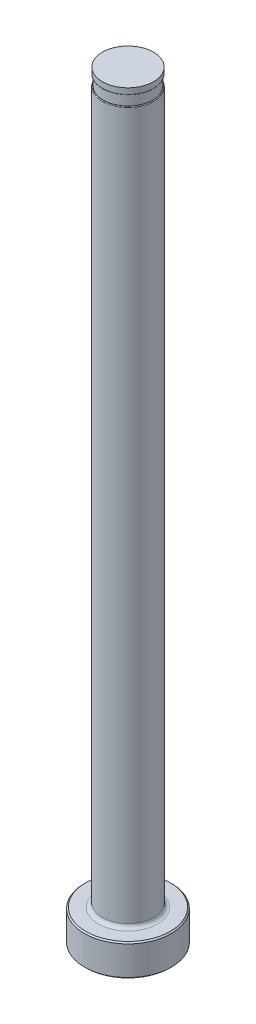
ISO-10303-21;
HEADER;
FILE_DESCRIPTION(('STEP AP214'),'2;1');
FILE_NAME('part.step','',(''),(''),'','','');
FILE_SCHEMA(('AUTOMOTIVE_DESIGN { 1 0 10303 214 1 1 1 1 }'));
ENDSEC;
DATA;
#1=APPLICATION_CONTEXT('core data for automotive mechanical design processes');
#2=APPLICATION_PROTOCOL_DEFINITION('international standard','automotive_design',2000,#1);
#3=PRODUCT_CONTEXT('',#1,'mechanical');
#4=PRODUCT('Part','Part','',(#3));
#5=PRODUCT_RELATED_PRODUCT_CATEGORY('part','',(#4));
#6=PRODUCT_DEFINITION_FORMATION('','',#4);
#7=PRODUCT_DEFINITION_CONTEXT('part definition',#1,'design');
#8=PRODUCT_DEFINITION('design','',#6,#7);
#9=PRODUCT_DEFINITION_SHAPE('','',#8);
#10=(LENGTH_UNIT() NAMED_UNIT(*) SI_UNIT(.MILLI.,.METRE.));
#11=(NAMED_UNIT(*) PLANE_ANGLE_UNIT() SI_UNIT($,.RADIAN.));
#12=(NAMED_UNIT(*) SI_UNIT($,.STERADIAN.) SOLID_ANGLE_UNIT());
#13=UNCERTAINTY_MEASURE_WITH_UNIT(LENGTH_MEASURE(1.E-05),#10,'distance_accuracy_value','');
#14=(GEOMETRIC_REPRESENTATION_CONTEXT(3) GLOBAL_UNCERTAINTY_ASSIGNED_CONTEXT((#13)) GLOBAL_UNIT_ASSIGNED_CONTEXT((#10,
#11,#12)) REPRESENTATION_CONTEXT('',''));
#15=CARTESIAN_POINT('',(0.,0.,0.));
#16=DIRECTION('',(0.,0.,1.));
#17=DIRECTION('',(1.,0.,0.));
#18=AXIS2_PLACEMENT_3D('',#15,#16,#17);
#19=CARTESIAN_POINT('',(-5.15873999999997,151.13,0.));
#20=DIRECTION('',(0.,1.,0.));
#21=DIRECTION('',(0.,0.,1.));
#22=AXIS2_PLACEMENT_3D('',#19,#20,#21);
#23=PLANE('',#22);
#24=CARTESIAN_POINT('',(0.,151.13,0.));
#25=DIRECTION('',(0.,1.,0.));
#26=DIRECTION('',(0.,0.,1.));
#27=AXIS2_PLACEMENT_3D('',#24,#25,#26);
#28=CIRCLE('',#27,5.01268999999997);
#29=CARTESIAN_POINT('',(0.,151.13,5.01268999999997));
#30=VERTEX_POINT('',#29);
#31=EDGE_CURVE('E11',#30,#30,#28,.F.);
#32=ORIENTED_EDGE('',*,*,#31,.T.);
#33=EDGE_LOOP('',(#32));
#34=FACE_BOUND('',#33,.T.);
#35=CARTESIAN_POINT('',(0.,151.13,0.));
#36=DIRECTION('',(0.,1.,0.));
#37=DIRECTION('',(0.,0.,1.));
#38=AXIS2_PLACEMENT_3D('',#35,#36,#37);
#39=CIRCLE('',#38,4.95553999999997);
#40=CARTESIAN_POINT('',(0.,151.13,4.95553999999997));
#41=VERTEX_POINT('',#40);
#42=EDGE_CURVE('E78',#41,#41,#39,.T.);
#43=ORIENTED_EDGE('',*,*,#42,.T.);
#44=EDGE_LOOP('',(#43));
#45=FACE_BOUND('',#44,.T.);
#46=ADVANCED_FACE('F36',(#34,#45),#23,.F.);
#47=CARTESIAN_POINT('',(0.,259.958771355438,0.));
#48=DIRECTION('',(0.,1.,0.));
#49=DIRECTION('',(0.,0.,1.));
#50=AXIS2_PLACEMENT_3D('',#47,#48,#49);
#51=CYLINDRICAL_SURFACE('',#50,5.15873999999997);
#52=DIRECTION('',(0.,1.,0.));
#53=VECTOR('',#52,1.);
#54=CARTESIAN_POINT('',(-4.95553999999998,259.958771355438,-1.43360444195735));
#55=LINE('',#54,#53);
#56=CARTESIAN_POINT('',(-4.95553999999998,148.971,-1.43360444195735));
#57=VERTEX_POINT('',#56);
#58=CARTESIAN_POINT('',(-4.95553999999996,86.614,-1.43360444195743));
#59=VERTEX_POINT('',#58);
#60=EDGE_CURVE('E73',#57,#59,#55,.F.);
#61=ORIENTED_EDGE('',*,*,#60,.F.);
#62=CARTESIAN_POINT('',(0.,148.971,0.));
#63=DIRECTION('',(0.,-1.,0.));
#64=DIRECTION('',(0.,0.,-1.));
#65=AXIS2_PLACEMENT_3D('',#62,#63,#64);
#66=CIRCLE('',#65,5.15873999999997);
#67=CARTESIAN_POINT('',(-4.95553999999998,148.971,1.43360444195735));
#68=VERTEX_POINT('',#67);
#69=EDGE_CURVE('E51',#57,#68,#66,.T.);
#70=ORIENTED_EDGE('',*,*,#69,.T.);
#71=DIRECTION('',(0.,1.,0.));
#72=VECTOR('',#71,1.);
#73=CARTESIAN_POINT('',(-4.95553999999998,259.958771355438,1.43360444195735));
#74=LINE('',#73,#72);
#75=CARTESIAN_POINT('',(-4.95553999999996,86.614,1.43360444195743));
#76=VERTEX_POINT('',#75);
#77=EDGE_CURVE('E84',#76,#68,#74,.T.);
#78=ORIENTED_EDGE('',*,*,#77,.F.);
#79=CARTESIAN_POINT('',(-4.95553999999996,86.614,-1.43360444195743));
#80=CARTESIAN_POINT('',(-4.95553725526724,86.5856189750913,-1.43360739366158));
#81=CARTESIAN_POINT('',(-4.95592104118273,86.5572557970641,-1.43228786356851));
#82=CARTESIAN_POINT('',(-4.95743326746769,86.5008072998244,-1.42704770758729));
#83=CARTESIAN_POINT('',(-4.9585612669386,86.4727218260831,-1.42312862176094));
#84=CARTESIAN_POINT('',(-4.9629961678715,86.3896356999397,-1.40761778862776));
#85=CARTESIAN_POINT('',(-4.96735491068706,86.3353485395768,-1.39227082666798));
#86=CARTESIAN_POINT('',(-4.97832723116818,86.2306470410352,-1.35250608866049));
#87=CARTESIAN_POINT('',(-4.98493672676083,86.18022589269,-1.32810472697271));
#88=CARTESIAN_POINT('',(-4.99967949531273,86.0841857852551,-1.27147840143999));
#89=CARTESIAN_POINT('',(-5.00781478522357,86.038573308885,-1.23924306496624));
#90=CARTESIAN_POINT('',(-5.02495905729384,85.9522108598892,-1.16779718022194));
#91=CARTESIAN_POINT('',(-5.03397951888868,85.9115461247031,-1.12848730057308));
#92=CARTESIAN_POINT('',(-5.05205730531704,85.8361357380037,-1.04458765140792));
#93=CARTESIAN_POINT('',(-5.0611146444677,85.8013926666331,-0.999995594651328));
#94=CARTESIAN_POINT('',(-5.0828087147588,85.722744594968,-0.884599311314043));
#95=CARTESIAN_POINT('',(-5.09511168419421,85.6822810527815,-0.811374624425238));
#96=CARTESIAN_POINT('',(-5.11705340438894,85.6135884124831,-0.659025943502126));
#97=CARTESIAN_POINT('',(-5.12668809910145,85.5853779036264,-0.579893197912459));
#98=CARTESIAN_POINT('',(-5.14250736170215,85.5402853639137,-0.417111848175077));
#99=CARTESIAN_POINT('',(-5.14864831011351,85.5235460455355,-0.333419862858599));
#100=CARTESIAN_POINT('',(-5.15681634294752,85.5014682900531,-0.164367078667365));
#101=CARTESIAN_POINT('',(-5.15884262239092,85.4961320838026,-0.0790059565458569));
#102=CARTESIAN_POINT('',(-5.15861184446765,85.4967349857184,0.105901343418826));
#103=CARTESIAN_POINT('',(-5.15558674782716,85.5046959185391,0.205446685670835));
#104=CARTESIAN_POINT('',(-5.14401053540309,85.5362458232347,0.401751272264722));
#105=CARTESIAN_POINT('',(-5.13546035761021,85.5598321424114,0.498510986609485));
#106=CARTESIAN_POINT('',(-5.11591338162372,85.6173193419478,0.667702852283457));
#107=CARTESIAN_POINT('',(-5.10571393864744,85.6483284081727,0.741210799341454));
#108=CARTESIAN_POINT('',(-5.08327564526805,85.7216570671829,0.882022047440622));
#109=CARTESIAN_POINT('',(-5.07103965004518,85.763960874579,0.949333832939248));
#110=CARTESIAN_POINT('',(-5.04847334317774,85.8504217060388,1.06213618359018));
#111=CARTESIAN_POINT('',(-5.03826194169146,85.892449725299,1.10927984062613));
#112=CARTESIAN_POINT('',(-5.01836605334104,85.9837827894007,1.19606762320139));
#113=CARTESIAN_POINT('',(-5.00868105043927,86.0330805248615,1.23571919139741));
#114=CARTESIAN_POINT('',(-4.99227488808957,86.1303011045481,1.30028176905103));
#115=CARTESIAN_POINT('',(-4.98532701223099,86.1773061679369,1.3265147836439));
#116=CARTESIAN_POINT('',(-4.97328889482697,86.2751640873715,1.37095861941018));
#117=CARTESIAN_POINT('',(-4.96819584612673,86.3260109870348,1.38918157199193));
#118=CARTESIAN_POINT('',(-4.96145831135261,86.4164594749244,1.41302693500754));
#119=CARTESIAN_POINT('',(-4.95925840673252,86.4554867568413,1.42070567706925));
#120=CARTESIAN_POINT('',(-4.95629015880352,86.5343307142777,1.43101136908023));
#121=CARTESIAN_POINT('',(-4.95552461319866,86.5741487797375,1.4336284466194));
#122=CARTESIAN_POINT('',(-4.95553999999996,86.614,1.43360444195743));
#123=B_SPLINE_CURVE_WITH_KNOTS('',3,(#79,#80,#81,#82,#83,#84,#85,#86,#87,#88,#89,#90,#91,#92,
#93,#94,#95,#96,#97,#98,#99,#100,#101,#102,#103,#104,#105,#106,#107,#108,#109,#110,#111,#112,
#113,#114,#115,#116,#117,#118,#119,#120,#121,#122),.UNSPECIFIED.,.F.,.F.,(4,2,2,2,2,2,2,2,2,2,2,
2,2,2,2,2,2,2,2,2,2,4),(0.,0.0850755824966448,0.170100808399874,0.338803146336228,
0.507201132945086,0.675823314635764,0.84702982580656,1.01831074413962,1.27062211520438,
1.52331494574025,1.77909706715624,2.03492922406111,2.33328986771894,2.63159987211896,
2.87199032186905,3.11204654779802,3.30325159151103,3.49426568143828,3.6564175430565,
3.81832296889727,3.93749321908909,4.05689566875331),.UNSPECIFIED.);
#124=EDGE_CURVE('E81',#59,#76,#123,.T.);
#125=ORIENTED_EDGE('',*,*,#124,.F.);
#126=EDGE_LOOP('',(#61,#70,#78,#125));
#127=FACE_BOUND('',#126,.T.);
#128=CARTESIAN_POINT('',(0.,7.11200000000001,0.));
#129=DIRECTION('',(0.,1.,0.));
#130=DIRECTION('',(0.,0.,1.));
#131=AXIS2_PLACEMENT_3D('',#128,#129,#130);
#132=CIRCLE('',#131,5.15873999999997);
#133=CARTESIAN_POINT('',(0.,7.11200000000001,5.15873999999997));
#134=VERTEX_POINT('',#133);
#135=EDGE_CURVE('E116',#134,#134,#132,.T.);
#136=ORIENTED_EDGE('',*,*,#135,.T.);
#137=EDGE_LOOP('',(#136));
#138=FACE_BOUND('',#137,.T.);
#139=ADVANCED_FACE('F82',(#127,#138),#51,.T.);
#140=CARTESIAN_POINT('',(0.,0.,0.));
#141=DIRECTION('',(0.,-1.,0.));
#142=DIRECTION('',(0.,0.,-1.));
#143=AXIS2_PLACEMENT_3D('',#140,#141,#142);
#144=PLANE('',#143);
#145=CARTESIAN_POINT('',(0.,0.,0.));
#146=DIRECTION('',(0.,-1.,0.));
#147=DIRECTION('',(0.,0.,-1.));
#148=AXIS2_PLACEMENT_3D('',#145,#146,#147);
#149=CIRCLE('',#148,8.47089999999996);
#150=CARTESIAN_POINT('',(0.,0.,-8.47089999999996));
#151=VERTEX_POINT('',#150);
#152=EDGE_CURVE('E113',#151,#151,#149,.T.);
#153=ORIENTED_EDGE('',*,*,#152,.T.);
#154=EDGE_LOOP('',(#153));
#155=FACE_BOUND('',#154,.T.);
#156=ADVANCED_FACE('F192',(#155),#144,.T.);
#157=CARTESIAN_POINT('',(0.,259.958771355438,0.));
#158=DIRECTION('',(0.,1.,0.));
#159=DIRECTION('',(0.,0.,1.));
#160=AXIS2_PLACEMENT_3D('',#157,#158,#159);
#161=CYLINDRICAL_SURFACE('',#160,8.72489999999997);
#162=CARTESIAN_POINT('',(0.,6.09600000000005,0.));
#163=DIRECTION('',(0.,1.,0.));
#164=DIRECTION('',(0.,0.,1.));
#165=AXIS2_PLACEMENT_3D('',#162,#163,#164);
#166=CIRCLE('',#165,8.72489999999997);
#167=CARTESIAN_POINT('',(0.,6.09600000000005,8.72489999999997));
#168=VERTEX_POINT('',#167);
#169=EDGE_CURVE('E110',#168,#168,#166,.F.);
#170=ORIENTED_EDGE('',*,*,#169,.T.);
#171=EDGE_LOOP('',(#170));
#172=FACE_BOUND('',#171,.T.);
#173=CARTESIAN_POINT('',(0.,0.254000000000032,0.));
#174=DIRECTION('',(0.,-1.,0.));
#175=DIRECTION('',(0.,0.,-1.));
#176=AXIS2_PLACEMENT_3D('',#173,#174,#175);
#177=CIRCLE('',#176,8.72489999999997);
#178=CARTESIAN_POINT('',(0.,0.254000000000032,-8.72489999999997));
#179=VERTEX_POINT('',#178);
#180=EDGE_CURVE('E107',#179,#179,#177,.F.);
#181=ORIENTED_EDGE('',*,*,#180,.T.);
#182=EDGE_LOOP('',(#181));
#183=FACE_BOUND('',#182,.T.);
#184=ADVANCED_FACE('F195',(#172,#183),#161,.T.);
#185=CARTESIAN_POINT('',(-8.72489999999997,6.35,0.));
#186=DIRECTION('',(0.,1.,0.));
#187=DIRECTION('',(0.,0.,1.));
#188=AXIS2_PLACEMENT_3D('',#185,#186,#187);
#189=PLANE('',#188);
#190=CARTESIAN_POINT('',(0.,6.35,0.));
#191=DIRECTION('',(0.,1.,0.));
#192=DIRECTION('',(0.,0.,1.));
#193=AXIS2_PLACEMENT_3D('',#190,#191,#192);
#194=CIRCLE('',#193,5.92073999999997);
#195=CARTESIAN_POINT('',(0.,6.35,5.92073999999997));
#196=VERTEX_POINT('',#195);
#197=EDGE_CURVE('E87',#196,#196,#194,.F.);
#198=ORIENTED_EDGE('',*,*,#197,.T.);
#199=EDGE_LOOP('',(#198));
#200=FACE_BOUND('',#199,.T.);
#201=CARTESIAN_POINT('',(0.,6.35,0.));
#202=DIRECTION('',(0.,1.,0.));
#203=DIRECTION('',(0.,0.,1.));
#204=AXIS2_PLACEMENT_3D('',#201,#202,#203);
#205=CIRCLE('',#204,8.47090000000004);
#206=CARTESIAN_POINT('',(0.,6.35,8.47090000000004));
#207=VERTEX_POINT('',#206);
#208=EDGE_CURVE('E104',#207,#207,#205,.T.);
#209=ORIENTED_EDGE('',*,*,#208,.T.);
#210=EDGE_LOOP('',(#209));
#211=FACE_BOUND('',#210,.T.);
#212=ADVANCED_FACE('F190',(#200,#211),#189,.T.);
#213=CARTESIAN_POINT('',(0.,6.35000000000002,0.));
#214=DIRECTION('',(0.,-1.,0.));
#215=DIRECTION('',(0.,0.,-1.));
#216=AXIS2_PLACEMENT_3D('',#213,#214,#215);
#217=CONICAL_SURFACE('',#216,8.47090000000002,0.785398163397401);
#218=ORIENTED_EDGE('',*,*,#169,.F.);
#219=EDGE_LOOP('',(#218));
#220=FACE_BOUND('',#219,.T.);
#221=ORIENTED_EDGE('',*,*,#208,.F.);
#222=EDGE_LOOP('',(#221));
#223=FACE_BOUND('',#222,.T.);
#224=ADVANCED_FACE('F186',(#220,#223),#217,.T.);
#225=CARTESIAN_POINT('',(0.,0.254000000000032,0.));
#226=DIRECTION('',(0.,1.,0.));
#227=DIRECTION('',(0.,0.,1.));
#228=AXIS2_PLACEMENT_3D('',#225,#226,#227);
#229=CONICAL_SURFACE('',#228,8.72489999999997,0.785398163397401);
#230=ORIENTED_EDGE('',*,*,#152,.F.);
#231=EDGE_LOOP('',(#230));
#232=FACE_BOUND('',#231,.T.);
#233=ORIENTED_EDGE('',*,*,#180,.F.);
#234=EDGE_LOOP('',(#233));
#235=FACE_BOUND('',#234,.T.);
#236=ADVANCED_FACE('F182',(#232,#235),#229,.T.);
#237=CARTESIAN_POINT('',(0.,7.11200000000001,0.));
#238=DIRECTION('',(0.,1.,0.));
#239=DIRECTION('',(0.,0.,1.));
#240=AXIS2_PLACEMENT_3D('',#237,#238,#239);
#241=TOROIDAL_SURFACE('',#240,5.92073999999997,0.762);
#242=ORIENTED_EDGE('',*,*,#197,.F.);
#243=EDGE_LOOP('',(#242));
#244=FACE_BOUND('',#243,.T.);
#245=ORIENTED_EDGE('',*,*,#135,.F.);
#246=EDGE_LOOP('',(#245));
#247=FACE_BOUND('',#246,.T.);
#248=ADVANCED_FACE('F147',(#244,#247),#241,.F.);
#249=CARTESIAN_POINT('',(-5.15873999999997,149.098,0.));
#250=DIRECTION('',(0.,-1.,0.));
#251=DIRECTION('',(0.,0.,-1.));
#252=AXIS2_PLACEMENT_3D('',#249,#250,#251);
#253=PLANE('',#252);
#254=DIRECTION('',(0.,0.,1.));
#255=VECTOR('',#254,1.);
#256=CARTESIAN_POINT('',(-4.95553999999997,149.098,0.));
#257=LINE('',#256,#255);
#258=CARTESIAN_POINT('',(-4.95553999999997,149.098,0.));
#259=VERTEX_POINT('',#258);
#260=CARTESIAN_POINT('',(-4.95553999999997,149.098,0.872370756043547));
#261=VERTEX_POINT('',#260);
#262=EDGE_CURVE('E90',#259,#261,#257,.T.);
#263=ORIENTED_EDGE('',*,*,#262,.T.);
#264=CARTESIAN_POINT('',(0.,149.098,0.));
#265=DIRECTION('',(0.,-1.,0.));
#266=DIRECTION('',(0.,0.,-1.));
#267=AXIS2_PLACEMENT_3D('',#264,#265,#266);
#268=CIRCLE('',#267,5.03173999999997);
#269=CARTESIAN_POINT('',(-4.95553999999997,149.098,-0.872370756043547));
#270=VERTEX_POINT('',#269);
#271=EDGE_CURVE('E86',#261,#270,#268,.F.);
#272=ORIENTED_EDGE('',*,*,#271,.T.);
#273=EDGE_CURVE('E79',#270,#259,#257,.T.);
#274=ORIENTED_EDGE('',*,*,#273,.T.);
#275=CARTESIAN_POINT('',(0.,149.098,0.));
#276=DIRECTION('',(0.,1.,0.));
#277=DIRECTION('',(0.,0.,1.));
#278=AXIS2_PLACEMENT_3D('',#275,#276,#277);
#279=CIRCLE('',#278,4.95553999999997);
#280=EDGE_CURVE('E101',#259,#259,#279,.T.);
#281=ORIENTED_EDGE('',*,*,#280,.F.);
#282=EDGE_LOOP('',(#263,#272,#274,#281));
#283=FACE_BOUND('',#282,.T.);
#284=ADVANCED_FACE('F144',(#283),#253,.F.);
#285=CARTESIAN_POINT('',(0.,153.448281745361,0.));
#286=DIRECTION('',(0.,1.,0.));
#287=DIRECTION('',(0.,0.,1.));
#288=AXIS2_PLACEMENT_3D('',#285,#286,#287);
#289=CYLINDRICAL_SURFACE('',#288,4.95553999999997);
#290=ORIENTED_EDGE('',*,*,#42,.F.);
#291=EDGE_LOOP('',(#290));
#292=FACE_BOUND('',#291,.T.);
#293=ORIENTED_EDGE('',*,*,#280,.T.);
#294=EDGE_LOOP('',(#293));
#295=FACE_BOUND('',#294,.T.);
#296=ADVANCED_FACE('F141',(#292,#295),#289,.T.);
#297=CARTESIAN_POINT('',(-4.95553999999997,150.114,-8.72489999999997));
#298=DIRECTION('',(1.,0.,0.));
#299=DIRECTION('',(0.,1.,0.));
#300=AXIS2_PLACEMENT_3D('',#297,#298,#299);
#301=PLANE('',#300);
#302=ORIENTED_EDGE('',*,*,#273,.F.);
#303=CARTESIAN_POINT('',(-4.95553999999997,149.098,-0.872370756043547));
#304=CARTESIAN_POINT('',(-4.95553999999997,149.097997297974,-0.893106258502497));
#305=CARTESIAN_POINT('',(-4.95553999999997,149.097847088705,-0.913843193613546));
#306=CARTESIAN_POINT('',(-4.95553999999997,149.097170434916,-0.955336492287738));
#307=CARTESIAN_POINT('',(-4.95553999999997,149.096643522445,-0.976092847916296));
#308=CARTESIAN_POINT('',(-4.95553999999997,149.095099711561,-1.01847199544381));
#309=CARTESIAN_POINT('',(-4.95553999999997,149.09406293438,-1.04009410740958));
#310=CARTESIAN_POINT('',(-4.95553999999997,149.091368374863,-1.08327970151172));
#311=CARTESIAN_POINT('',(-4.95553999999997,149.089711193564,-1.10484322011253));
#312=CARTESIAN_POINT('',(-4.95553999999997,149.085606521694,-1.14789214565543));
#313=CARTESIAN_POINT('',(-4.95553999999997,149.083159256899,-1.16937757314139));
#314=CARTESIAN_POINT('',(-4.95553999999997,149.077206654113,-1.21226394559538));
#315=CARTESIAN_POINT('',(-4.95553999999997,149.073698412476,-1.23366449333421));
#316=CARTESIAN_POINT('',(-4.95553999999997,149.065283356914,-1.27578226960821));
#317=CARTESIAN_POINT('',(-4.95553999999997,149.06040504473,-1.29650469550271));
#318=CARTESIAN_POINT('',(-4.95553999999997,149.051386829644,-1.32704228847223));
#319=CARTESIAN_POINT('',(-4.95553999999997,149.048106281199,-1.33710914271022));
#320=CARTESIAN_POINT('',(-4.95553999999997,149.04076790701,-1.35695139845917));
#321=CARTESIAN_POINT('',(-4.95553999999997,149.036711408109,-1.36672726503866));
#322=CARTESIAN_POINT('',(-4.95553999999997,149.029963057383,-1.38055335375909));
#323=CARTESIAN_POINT('',(-4.95553999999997,149.027728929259,-1.38482589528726));
#324=CARTESIAN_POINT('',(-4.95553999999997,149.022950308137,-1.39320953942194));
#325=CARTESIAN_POINT('',(-4.95553999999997,149.020405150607,-1.39732027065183));
#326=CARTESIAN_POINT('',(-4.95553999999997,149.014903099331,-1.40530983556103));
#327=CARTESIAN_POINT('',(-4.95553999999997,149.011943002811,-1.4091864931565));
#328=CARTESIAN_POINT('',(-4.95553999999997,149.005504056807,-1.4164922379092));
#329=CARTESIAN_POINT('',(-4.95553999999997,149.002026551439,-1.41992244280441));
#330=CARTESIAN_POINT('',(-4.95553999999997,148.996255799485,-1.4245087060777));
#331=CARTESIAN_POINT('',(-4.95553999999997,148.994201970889,-1.42596287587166));
#332=CARTESIAN_POINT('',(-4.95553999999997,148.989918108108,-1.42856560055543));
#333=CARTESIAN_POINT('',(-4.95553999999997,148.98768896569,-1.42971558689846));
#334=CARTESIAN_POINT('',(-4.95553999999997,148.983116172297,-1.4315912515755));
#335=CARTESIAN_POINT('',(-4.95553999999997,148.980776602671,-1.43232653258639));
#336=CARTESIAN_POINT('',(-4.95553999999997,148.975963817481,-1.43334161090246));
#337=CARTESIAN_POINT('',(-4.95553999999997,148.973489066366,-1.43361396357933));
#338=CARTESIAN_POINT('',(-4.95553999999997,148.971,-1.4336044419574));
#339=B_SPLINE_CURVE_WITH_KNOTS('',3,(#303,#304,#305,#306,#307,#308,#309,#310,#311,#312,#313,
#314,#315,#316,#317,#318,#319,#320,#321,#322,#323,#324,#325,#326,#327,#328,#329,#330,#331,#332,
#333,#334,#335,#336,#337,#338),.UNSPECIFIED.,.F.,.F.,(4,2,2,2,2,2,2,2,2,2,2,2,2,2,2,2,2,4),(0.,
0.062208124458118,0.124493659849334,0.189427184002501,0.254297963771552,0.319150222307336,
0.384181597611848,0.447949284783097,0.479695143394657,0.511387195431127,0.525842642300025,
0.54032953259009,0.554935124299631,0.569503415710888,0.577034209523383,0.584528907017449,
0.591842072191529,0.599271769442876),.UNSPECIFIED.);
#340=EDGE_CURVE('E59',#270,#57,#339,.T.);
#341=ORIENTED_EDGE('',*,*,#340,.T.);
#342=ORIENTED_EDGE('',*,*,#60,.T.);
#343=DIRECTION('',(0.,0.,1.));
#344=VECTOR('',#343,1.);
#345=CARTESIAN_POINT('',(-4.95553999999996,86.614,-8.72489999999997));
#346=LINE('',#345,#344);
#347=EDGE_CURVE('E77',#59,#76,#346,.T.);
#348=ORIENTED_EDGE('',*,*,#347,.T.);
#349=ORIENTED_EDGE('',*,*,#77,.T.);
#350=CARTESIAN_POINT('',(-4.95553999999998,148.971,1.43360444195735));
#351=CARTESIAN_POINT('',(-4.95553999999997,148.973376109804,1.43361259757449));
#352=CARTESIAN_POINT('',(-4.95553999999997,148.975740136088,1.4333648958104));
#353=CARTESIAN_POINT('',(-4.95553999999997,148.980346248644,1.43243706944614));
#354=CARTESIAN_POINT('',(-4.95553999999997,148.982589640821,1.43176356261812));
#355=CARTESIAN_POINT('',(-4.95553999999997,148.987448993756,1.4298565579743));
#356=CARTESIAN_POINT('',(-4.95553999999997,148.990026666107,1.42852797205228));
#357=CARTESIAN_POINT('',(-4.95553999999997,148.994948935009,1.42547523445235));
#358=CARTESIAN_POINT('',(-4.95553999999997,148.997291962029,1.42374864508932));
#359=CARTESIAN_POINT('',(-4.95553999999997,149.003411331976,1.4186377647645));
#360=CARTESIAN_POINT('',(-4.95553999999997,149.006953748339,1.41497736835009));
#361=CARTESIAN_POINT('',(-4.95553999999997,149.013498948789,1.40721445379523));
#362=CARTESIAN_POINT('',(-4.95553999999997,149.016500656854,1.40311107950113));
#363=CARTESIAN_POINT('',(-4.95553999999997,149.023478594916,1.39255193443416));
#364=CARTESIAN_POINT('',(-4.95553999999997,149.027205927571,1.38593356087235));
#365=CARTESIAN_POINT('',(-4.95553999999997,149.034038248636,1.37237820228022));
#366=CARTESIAN_POINT('',(-4.95553999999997,149.037141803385,1.36544052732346));
#367=CARTESIAN_POINT('',(-4.95553999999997,149.045787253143,1.34428318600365));
#368=CARTESIAN_POINT('',(-4.95553999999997,149.050628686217,1.32978099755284));
#369=CARTESIAN_POINT('',(-4.95553999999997,149.063034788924,1.28723764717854));
#370=CARTESIAN_POINT('',(-4.95553999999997,149.069113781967,1.25878972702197));
#371=CARTESIAN_POINT('',(-4.95553999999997,149.079029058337,1.20147182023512));
#372=CARTESIAN_POINT('',(-4.95553999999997,149.082859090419,1.17260088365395));
#373=CARTESIAN_POINT('',(-4.95553999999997,149.088985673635,1.1146900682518));
#374=CARTESIAN_POINT('',(-4.95553999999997,149.091281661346,1.08565013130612));
#375=CARTESIAN_POINT('',(-4.95553999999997,149.094773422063,1.02754153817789));
#376=CARTESIAN_POINT('',(-4.95553999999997,149.095970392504,0.998472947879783));
#377=CARTESIAN_POINT('',(-4.95553999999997,149.09719494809,0.953200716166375));
#378=CARTESIAN_POINT('',(-4.95553999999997,149.097505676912,0.937003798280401));
#379=CARTESIAN_POINT('',(-4.95553999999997,149.097907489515,0.90466142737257));
#380=CARTESIAN_POINT('',(-4.95553999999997,149.097999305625,0.888515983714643));
#381=CARTESIAN_POINT('',(-4.95553999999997,149.098,0.872370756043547));
#382=B_SPLINE_CURVE_WITH_KNOTS('',3,(#350,#351,#352,#353,#354,#355,#356,#357,#358,#359,#360,
#361,#362,#363,#364,#365,#366,#367,#368,#369,#370,#371,#372,#373,#374,#375,#376,#377,#378,#379,
#380,#381),.UNSPECIFIED.,.F.,.F.,(4,2,2,2,2,2,2,2,2,2,2,2,2,2,2,4),(0.,0.00709610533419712,
0.0140845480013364,0.0227350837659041,0.0314400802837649,0.0466358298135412,0.0618614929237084,
0.0845916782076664,0.107373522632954,0.153148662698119,0.240236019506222,0.327564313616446,
0.414924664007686,0.502189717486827,0.550788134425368,0.599223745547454),.UNSPECIFIED.);
#383=EDGE_CURVE('E172',#68,#261,#382,.T.);
#384=ORIENTED_EDGE('',*,*,#383,.T.);
#385=ORIENTED_EDGE('',*,*,#262,.F.);
#386=EDGE_LOOP('',(#302,#341,#342,#348,#349,#384,#385));
#387=FACE_BOUND('',#386,.T.);
#388=ADVANCED_FACE('F75',(#387),#301,.F.);
#389=CARTESIAN_POINT('',(-8.13053999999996,86.614,-8.72489999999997));
#390=DIRECTION('',(0.,0.,1.));
#391=DIRECTION('',(1.,0.,0.));
#392=AXIS2_PLACEMENT_3D('',#389,#390,#391);
#393=CYLINDRICAL_SURFACE('',#392,3.175);
#394=ORIENTED_EDGE('',*,*,#347,.F.);
#395=ORIENTED_EDGE('',*,*,#124,.T.);
#396=EDGE_LOOP('',(#394,#395));
#397=FACE_BOUND('',#396,.T.);
#398=ADVANCED_FACE('F89',(#397),#393,.F.);
#399=CARTESIAN_POINT('',(0.,152.687735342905,0.));
#400=DIRECTION('',(0.,1.,0.));
#401=DIRECTION('',(0.,0.,1.));
#402=AXIS2_PLACEMENT_3D('',#399,#400,#401);
#403=CYLINDRICAL_SURFACE('',#402,5.13968999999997);
#404=CARTESIAN_POINT('',(0.,151.257,0.));
#405=DIRECTION('',(0.,1.,0.));
#406=DIRECTION('',(0.,0.,1.));
#407=AXIS2_PLACEMENT_3D('',#404,#405,#406);
#408=CIRCLE('',#407,5.13968999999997);
#409=CARTESIAN_POINT('',(0.,151.257,5.13968999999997));
#410=VERTEX_POINT('',#409);
#411=EDGE_CURVE('E44',#410,#410,#408,.T.);
#412=ORIENTED_EDGE('',*,*,#411,.T.);
#413=EDGE_LOOP('',(#412));
#414=FACE_BOUND('',#413,.T.);
#415=CARTESIAN_POINT('',(0.,152.4,0.));
#416=DIRECTION('',(0.,1.,0.));
#417=DIRECTION('',(0.,0.,1.));
#418=AXIS2_PLACEMENT_3D('',#415,#416,#417);
#419=CIRCLE('',#418,5.13968999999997);
#420=CARTESIAN_POINT('',(0.,152.4,5.13968999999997));
#421=VERTEX_POINT('',#420);
#422=EDGE_CURVE('E91',#421,#421,#419,.T.);
#423=ORIENTED_EDGE('',*,*,#422,.F.);
#424=EDGE_LOOP('',(#423));
#425=FACE_BOUND('',#424,.T.);
#426=ADVANCED_FACE('F135',(#414,#425),#403,.T.);
#427=CARTESIAN_POINT('',(-5.15873999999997,152.4,0.));
#428=DIRECTION('',(0.,1.,0.));
#429=DIRECTION('',(0.,0.,1.));
#430=AXIS2_PLACEMENT_3D('',#427,#428,#429);
#431=PLANE('',#430);
#432=ORIENTED_EDGE('',*,*,#422,.T.);
#433=EDGE_LOOP('',(#432));
#434=FACE_BOUND('',#433,.T.);
#435=ADVANCED_FACE('F149',(#434),#431,.T.);
#436=CARTESIAN_POINT('',(0.,148.971,0.));
#437=DIRECTION('',(0.,-1.,0.));
#438=DIRECTION('',(0.,0.,-1.));
#439=AXIS2_PLACEMENT_3D('',#436,#437,#438);
#440=TOROIDAL_SURFACE('',#439,5.03173999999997,0.127);
#441=ORIENTED_EDGE('',*,*,#383,.F.);
#442=ORIENTED_EDGE('',*,*,#69,.F.);
#443=ORIENTED_EDGE('',*,*,#340,.F.);
#444=ORIENTED_EDGE('',*,*,#271,.F.);
#445=EDGE_LOOP('',(#441,#442,#443,#444));
#446=FACE_BOUND('',#445,.T.);
#447=ADVANCED_FACE('F151',(#446),#440,.T.);
#448=CARTESIAN_POINT('',(0.,151.257,0.));
#449=DIRECTION('',(0.,1.,0.));
#450=DIRECTION('',(0.,0.,1.));
#451=AXIS2_PLACEMENT_3D('',#448,#449,#450);
#452=TOROIDAL_SURFACE('',#451,5.01268999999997,0.127);
#453=ORIENTED_EDGE('',*,*,#31,.F.);
#454=EDGE_LOOP('',(#453));
#455=FACE_BOUND('',#454,.T.);
#456=ORIENTED_EDGE('',*,*,#411,.F.);
#457=EDGE_LOOP('',(#456));
#458=FACE_BOUND('',#457,.T.);
#459=ADVANCED_FACE('F38',(#455,#458),#452,.T.);
#460=CLOSED_SHELL('',(#46,#139,#156,#184,#212,#224,#236,#248,#284,#296,#388,#398,#426,#435,#447,#459));
#461=MANIFOLD_SOLID_BREP('B2',#460);
#462=ADVANCED_BREP_SHAPE_REPRESENTATION('',(#18,#461),#14);
#463=SHAPE_DEFINITION_REPRESENTATION(#9,#462);
ENDSEC;
END-ISO-10303-21;
